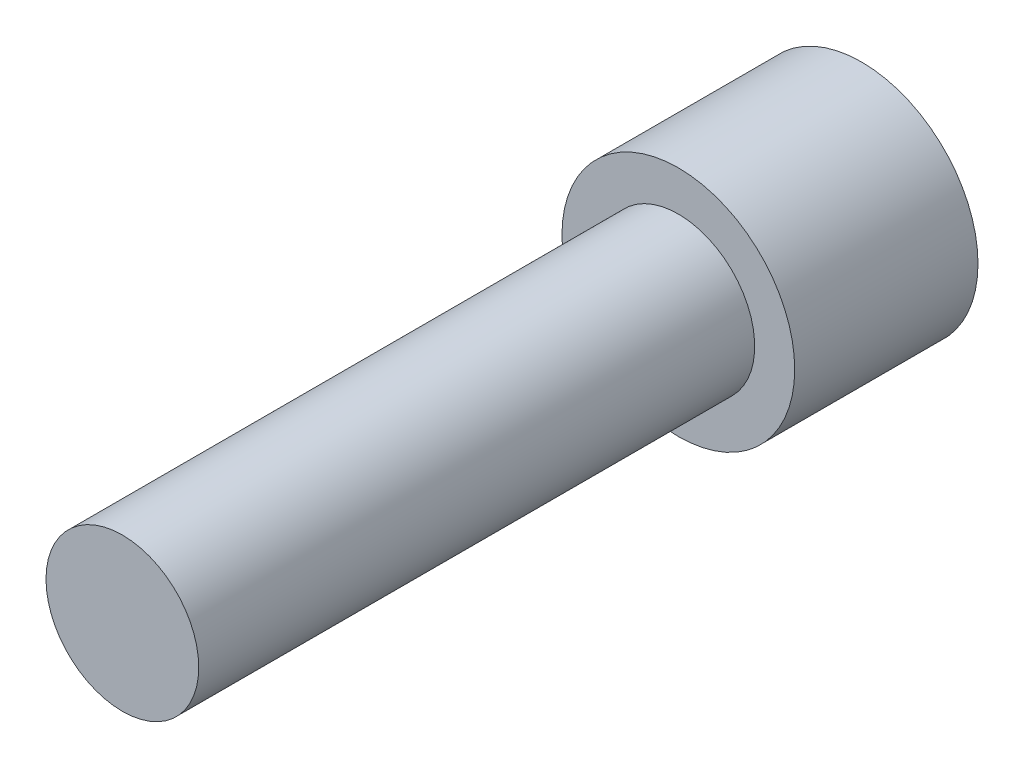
from build123d import *

# Parameters (mm, degrees)
CROQUIS1_R            = 12.5
EXTRUIR1_DEPTH        = 91
CROQUIS2_R            = 19.05
EXTRUIR2_DEPTH        = 30
CROQUIS3_R            = 6
CORTAR_EXTRUIR1_DEPTH = 20
CROQUIS5_R            = 2.375
CORTAR_EXTRUIR3_DEPTH = 15


with BuildPart() as part:
    # Croquis1 → Extruir1 (new body)
    with BuildSketch(Plane.XY):
        Circle(CROQUIS1_R)
    extrude(amount=EXTRUIR1_DEPTH)

    # Croquis2 → Extruir2 (add)
    with BuildSketch(Plane(origin=(0, 0, 0), x_dir=(-1, 0, 0), z_dir=(0, 0, -1))):
        Circle(CROQUIS2_R)
    extrude(amount=EXTRUIR2_DEPTH)

    # Croquis3 → Cortar-Extruir1 (cut)
    with BuildSketch(Plane(origin=(0, 0, -30), x_dir=(-1, 0, 0), z_dir=(0, 0, -1))):
        Circle(CROQUIS3_R)
    extrude(amount=-CORTAR_EXTRUIR1_DEPTH, mode=Mode.SUBTRACT)

    # Croquis5 → Cortar-Extruir3 (cut)
    with BuildSketch(Plane(origin=(0, 0, -30), x_dir=(-1, 0, 0), z_dir=(0, 0, -1))):
        with Locations((12.525, 0)):
            Circle(CROQUIS5_R)
        with Locations(Location((-12.525, 0, 0), (0, 0, 180))):
            Circle(CROQUIS5_R)
    extrude(amount=-CORTAR_EXTRUIR3_DEPTH, mode=Mode.SUBTRACT)


solid = part.part
